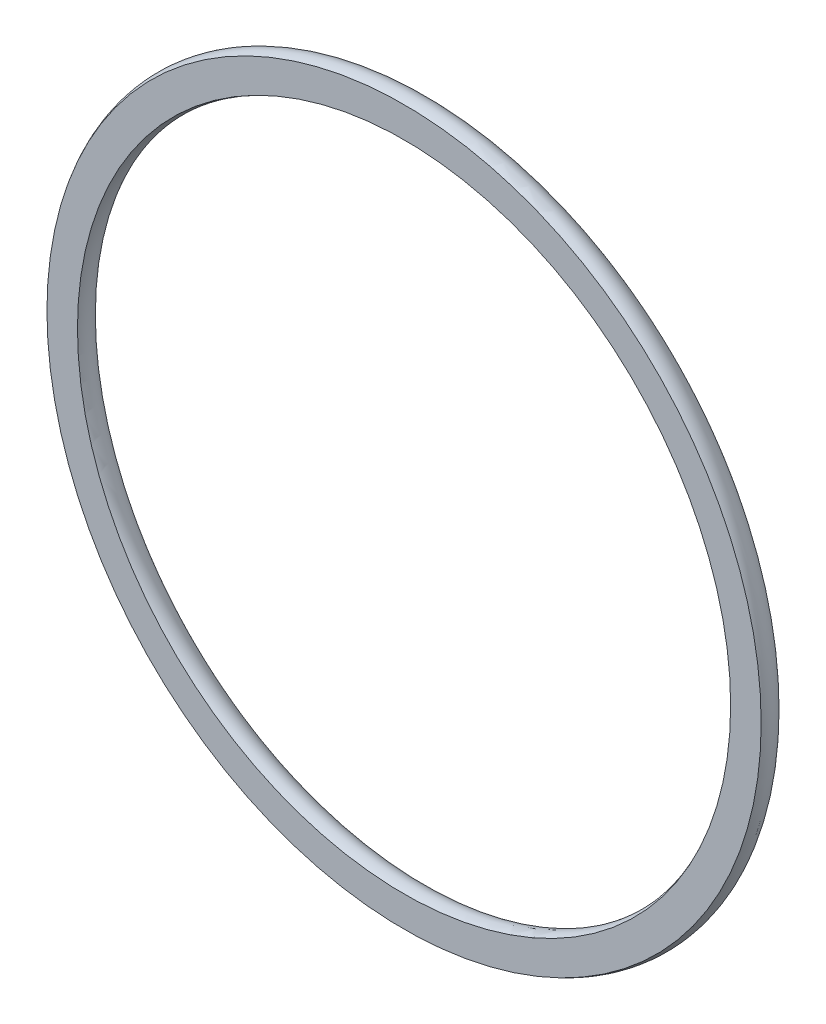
from build123d import *

# Parameters (mm, degrees)
SKETCH1_R          = 0.889
SKETCH2_W          = 49.525585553
SKETCH2_H          = 43.135187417
CUT_EXTRUDE1_DEPTH = 0.4572


with BuildPart() as part:
    # Sketch1 → Revolve1 (revolve)
    with BuildSketch(Plane(origin=(0, 0, 0), x_dir=(0, -1, 0), z_dir=(1, 0, 0)), mode=Mode.PRIVATE) as revolve1_sk:
        with Locations((17.4117, 0)):
            Circle(SKETCH1_R)
    revolve(revolve1_sk.sketch.rotate(Axis((0, 0, 0.889), (0, 0, -1)), 270), axis=Axis((0, 0, 0.889), (0, 0, -1)))

    # Sketch2 → Cut-Extrude1 (cut)
    with BuildSketch(Plane.XY.offset(0.889)):
        with Locations((3.158331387, 0.626750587)):
            Rectangle(SKETCH2_W, SKETCH2_H)
    extrude(amount=-CUT_EXTRUDE1_DEPTH, mode=Mode.SUBTRACT)


solid = part.part
